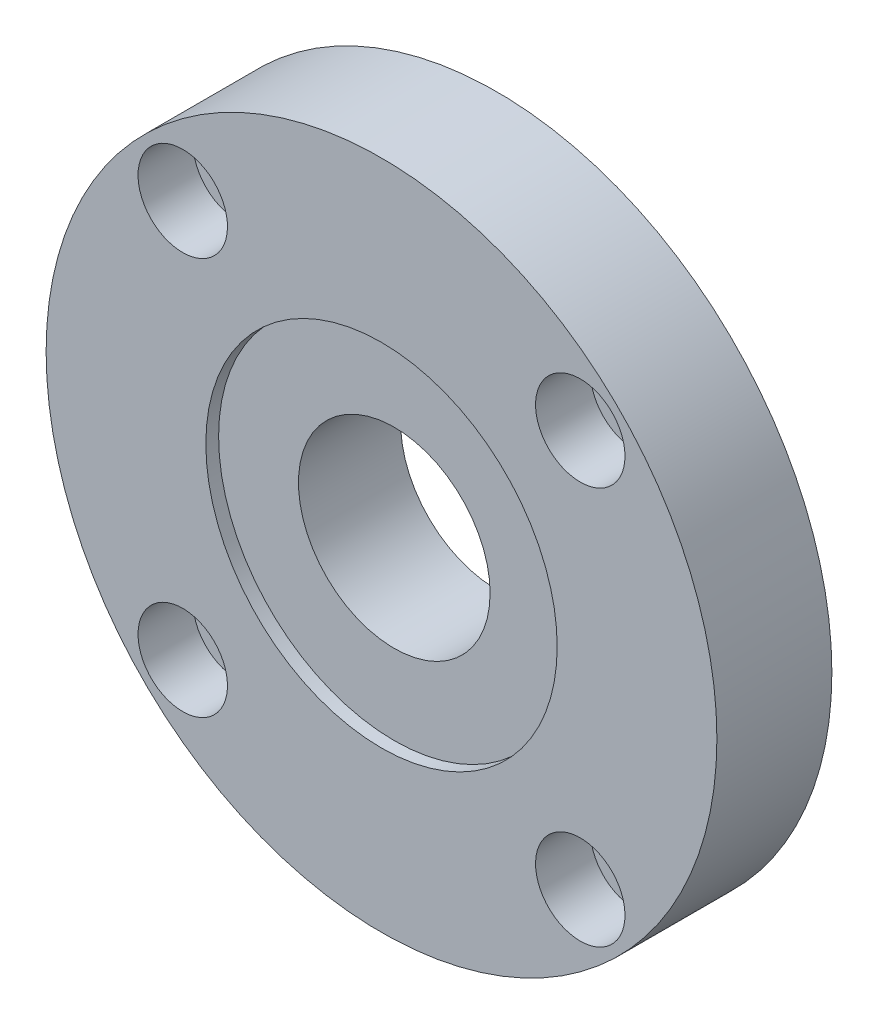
ISO-10303-21;
HEADER;
FILE_DESCRIPTION(('STEP AP214'),'2;1');
FILE_NAME('part.step','',(''),(''),'','','');
FILE_SCHEMA(('AUTOMOTIVE_DESIGN { 1 0 10303 214 1 1 1 1 }'));
ENDSEC;
DATA;
#1=APPLICATION_CONTEXT('core data for automotive mechanical design processes');
#2=APPLICATION_PROTOCOL_DEFINITION('international standard','automotive_design',2000,#1);
#3=PRODUCT_CONTEXT('',#1,'mechanical');
#4=PRODUCT('Part','Part','',(#3));
#5=PRODUCT_RELATED_PRODUCT_CATEGORY('part','',(#4));
#6=PRODUCT_DEFINITION_FORMATION('','',#4);
#7=PRODUCT_DEFINITION_CONTEXT('part definition',#1,'design');
#8=PRODUCT_DEFINITION('design','',#6,#7);
#9=PRODUCT_DEFINITION_SHAPE('','',#8);
#10=(LENGTH_UNIT() NAMED_UNIT(*) SI_UNIT(.MILLI.,.METRE.));
#11=(NAMED_UNIT(*) PLANE_ANGLE_UNIT() SI_UNIT($,.RADIAN.));
#12=(NAMED_UNIT(*) SI_UNIT($,.STERADIAN.) SOLID_ANGLE_UNIT());
#13=UNCERTAINTY_MEASURE_WITH_UNIT(LENGTH_MEASURE(1.E-05),#10,'distance_accuracy_value','');
#14=(GEOMETRIC_REPRESENTATION_CONTEXT(3) GLOBAL_UNCERTAINTY_ASSIGNED_CONTEXT((#13)) GLOBAL_UNIT_ASSIGNED_CONTEXT((#10,
#11,#12)) REPRESENTATION_CONTEXT('',''));
#15=CARTESIAN_POINT('',(0.,0.,0.));
#16=DIRECTION('',(0.,0.,1.));
#17=DIRECTION('',(1.,0.,0.));
#18=AXIS2_PLACEMENT_3D('',#15,#16,#17);
#19=CARTESIAN_POINT('',(0.,0.,18.));
#20=DIRECTION('',(0.,0.,-1.));
#21=DIRECTION('',(-1.,0.,0.));
#22=AXIS2_PLACEMENT_3D('',#19,#20,#21);
#23=CYLINDRICAL_SURFACE('',#22,15.);
#24=CARTESIAN_POINT('',(0.,0.,0.));
#25=DIRECTION('',(0.,0.,1.));
#26=DIRECTION('',(1.,0.,0.));
#27=AXIS2_PLACEMENT_3D('',#24,#25,#26);
#28=CIRCLE('',#27,15.);
#29=CARTESIAN_POINT('',(15.,0.,0.));
#30=VERTEX_POINT('',#29);
#31=EDGE_CURVE('E25',#30,#30,#28,.T.);
#32=ORIENTED_EDGE('',*,*,#31,.F.);
#33=EDGE_LOOP('',(#32));
#34=FACE_BOUND('',#33,.T.);
#35=CARTESIAN_POINT('',(0.,0.,16.));
#36=DIRECTION('',(0.,0.,1.));
#37=DIRECTION('',(1.,0.,0.));
#38=AXIS2_PLACEMENT_3D('',#35,#36,#37);
#39=CIRCLE('',#38,15.);
#40=CARTESIAN_POINT('',(15.,0.,16.));
#41=VERTEX_POINT('',#40);
#42=EDGE_CURVE('E16',#41,#41,#39,.T.);
#43=ORIENTED_EDGE('',*,*,#42,.T.);
#44=EDGE_LOOP('',(#43));
#45=FACE_BOUND('',#44,.T.);
#46=ADVANCED_FACE('F12',(#34,#45),#23,.F.);
#47=CARTESIAN_POINT('',(-31.1126983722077,31.1126983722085,0.));
#48=DIRECTION('',(0.,0.,1.));
#49=DIRECTION('',(1.,0.,0.));
#50=AXIS2_PLACEMENT_3D('',#47,#48,#49);
#51=CYLINDRICAL_SURFACE('',#50,5.);
#52=CARTESIAN_POINT('',(-31.1126983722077,31.1126983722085,0.));
#53=DIRECTION('',(0.,0.,1.));
#54=DIRECTION('',(0.,1.,0.));
#55=AXIS2_PLACEMENT_3D('',#52,#53,#54);
#56=CIRCLE('',#55,5.);
#57=CARTESIAN_POINT('',(-31.1126983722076,36.1126983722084,0.));
#58=VERTEX_POINT('',#57);
#59=EDGE_CURVE('E37',#58,#58,#56,.T.);
#60=ORIENTED_EDGE('',*,*,#59,.F.);
#61=EDGE_LOOP('',(#60));
#62=FACE_BOUND('',#61,.T.);
#63=CARTESIAN_POINT('',(-31.1126983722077,31.1126983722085,9.4));
#64=DIRECTION('',(0.,0.,1.));
#65=DIRECTION('',(1.,0.,0.));
#66=AXIS2_PLACEMENT_3D('',#63,#64,#65);
#67=CIRCLE('',#66,5.);
#68=CARTESIAN_POINT('',(-26.1126983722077,31.1126983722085,9.4));
#69=VERTEX_POINT('',#68);
#70=EDGE_CURVE('E43',#69,#69,#67,.F.);
#71=ORIENTED_EDGE('',*,*,#70,.F.);
#72=EDGE_LOOP('',(#71));
#73=FACE_BOUND('',#72,.T.);
#74=ADVANCED_FACE('F87',(#62,#73),#51,.F.);
#75=CARTESIAN_POINT('',(-31.1126983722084,-31.1126983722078,0.));
#76=DIRECTION('',(0.,0.,1.));
#77=DIRECTION('',(1.,0.,0.));
#78=AXIS2_PLACEMENT_3D('',#75,#76,#77);
#79=CYLINDRICAL_SURFACE('',#78,5.);
#80=CARTESIAN_POINT('',(-31.1126983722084,-31.1126983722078,0.));
#81=DIRECTION('',(0.,0.,1.));
#82=DIRECTION('',(-1.,0.,0.));
#83=AXIS2_PLACEMENT_3D('',#80,#81,#82);
#84=CIRCLE('',#83,5.);
#85=CARTESIAN_POINT('',(-36.1126983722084,-31.1126983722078,0.));
#86=VERTEX_POINT('',#85);
#87=EDGE_CURVE('E68',#86,#86,#84,.T.);
#88=ORIENTED_EDGE('',*,*,#87,.F.);
#89=EDGE_LOOP('',(#88));
#90=FACE_BOUND('',#89,.T.);
#91=CARTESIAN_POINT('',(-31.1126983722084,-31.1126983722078,9.4));
#92=DIRECTION('',(0.,0.,1.));
#93=DIRECTION('',(1.,0.,0.));
#94=AXIS2_PLACEMENT_3D('',#91,#92,#93);
#95=CIRCLE('',#94,5.);
#96=CARTESIAN_POINT('',(-26.1126983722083,-31.1126983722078,9.4));
#97=VERTEX_POINT('',#96);
#98=EDGE_CURVE('E39',#97,#97,#95,.F.);
#99=ORIENTED_EDGE('',*,*,#98,.F.);
#100=EDGE_LOOP('',(#99));
#101=FACE_BOUND('',#100,.T.);
#102=ADVANCED_FACE('F160',(#90,#101),#79,.F.);
#103=CARTESIAN_POINT('',(31.112698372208,-31.1126983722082,0.));
#104=DIRECTION('',(0.,0.,1.));
#105=DIRECTION('',(1.,0.,0.));
#106=AXIS2_PLACEMENT_3D('',#103,#104,#105);
#107=CYLINDRICAL_SURFACE('',#106,5.);
#108=CARTESIAN_POINT('',(31.112698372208,-31.1126983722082,0.));
#109=DIRECTION('',(0.,0.,1.));
#110=DIRECTION('',(0.,-1.,0.));
#111=AXIS2_PLACEMENT_3D('',#108,#109,#110);
#112=CIRCLE('',#111,5.);
#113=CARTESIAN_POINT('',(31.1126983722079,-36.1126983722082,0.));
#114=VERTEX_POINT('',#113);
#115=EDGE_CURVE('E71',#114,#114,#112,.T.);
#116=ORIENTED_EDGE('',*,*,#115,.F.);
#117=EDGE_LOOP('',(#116));
#118=FACE_BOUND('',#117,.T.);
#119=CARTESIAN_POINT('',(31.112698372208,-31.1126983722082,9.4));
#120=DIRECTION('',(0.,0.,1.));
#121=DIRECTION('',(1.,0.,0.));
#122=AXIS2_PLACEMENT_3D('',#119,#120,#121);
#123=CIRCLE('',#122,5.);
#124=CARTESIAN_POINT('',(36.112698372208,-31.1126983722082,9.4));
#125=VERTEX_POINT('',#124);
#126=EDGE_CURVE('E34',#125,#125,#123,.F.);
#127=ORIENTED_EDGE('',*,*,#126,.F.);
#128=EDGE_LOOP('',(#127));
#129=FACE_BOUND('',#128,.T.);
#130=ADVANCED_FACE('F135',(#118,#129),#107,.F.);
#131=CARTESIAN_POINT('',(31.1126983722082,31.1126983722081,0.));
#132=DIRECTION('',(0.,0.,1.));
#133=DIRECTION('',(1.,0.,0.));
#134=AXIS2_PLACEMENT_3D('',#131,#132,#133);
#135=CYLINDRICAL_SURFACE('',#134,5.);
#136=CARTESIAN_POINT('',(31.1126983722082,31.1126983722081,0.));
#137=DIRECTION('',(0.,0.,1.));
#138=DIRECTION('',(1.,0.,0.));
#139=AXIS2_PLACEMENT_3D('',#136,#137,#138);
#140=CIRCLE('',#139,5.);
#141=CARTESIAN_POINT('',(36.1126983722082,31.1126983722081,0.));
#142=VERTEX_POINT('',#141);
#143=EDGE_CURVE('E32',#142,#142,#140,.T.);
#144=ORIENTED_EDGE('',*,*,#143,.F.);
#145=EDGE_LOOP('',(#144));
#146=FACE_BOUND('',#145,.T.);
#147=CARTESIAN_POINT('',(31.1126983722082,31.1126983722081,9.4));
#148=DIRECTION('',(0.,0.,1.));
#149=DIRECTION('',(1.,0.,0.));
#150=AXIS2_PLACEMENT_3D('',#147,#148,#149);
#151=CIRCLE('',#150,5.);
#152=CARTESIAN_POINT('',(36.1126983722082,31.1126983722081,9.4));
#153=VERTEX_POINT('',#152);
#154=EDGE_CURVE('E29',#153,#153,#151,.F.);
#155=ORIENTED_EDGE('',*,*,#154,.F.);
#156=EDGE_LOOP('',(#155));
#157=FACE_BOUND('',#156,.T.);
#158=ADVANCED_FACE('F106',(#146,#157),#135,.F.);
#159=CARTESIAN_POINT('',(0.,0.,18.));
#160=DIRECTION('',(0.,0.,1.));
#161=DIRECTION('',(1.,0.,0.));
#162=AXIS2_PLACEMENT_3D('',#159,#160,#161);
#163=PLANE('',#162);
#164=CARTESIAN_POINT('',(0.,0.,18.));
#165=DIRECTION('',(0.,0.,1.));
#166=DIRECTION('',(1.,0.,0.));
#167=AXIS2_PLACEMENT_3D('',#164,#165,#166);
#168=CIRCLE('',#167,27.5);
#169=CARTESIAN_POINT('',(27.5,0.,18.));
#170=VERTEX_POINT('',#169);
#171=EDGE_CURVE('E94',#170,#170,#168,.T.);
#172=ORIENTED_EDGE('',*,*,#171,.F.);
#173=EDGE_LOOP('',(#172));
#174=FACE_BOUND('',#173,.T.);
#175=CARTESIAN_POINT('',(-31.1126983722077,31.1126983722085,18.));
#176=DIRECTION('',(0.,0.,1.));
#177=DIRECTION('',(0.,1.,0.));
#178=AXIS2_PLACEMENT_3D('',#175,#176,#177);
#179=CIRCLE('',#178,7.);
#180=CARTESIAN_POINT('',(-31.1126983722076,38.1126983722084,18.));
#181=VERTEX_POINT('',#180);
#182=EDGE_CURVE('E52',#181,#181,#179,.T.);
#183=ORIENTED_EDGE('',*,*,#182,.F.);
#184=EDGE_LOOP('',(#183));
#185=FACE_BOUND('',#184,.T.);
#186=CARTESIAN_POINT('',(-31.1126983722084,-31.1126983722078,18.));
#187=DIRECTION('',(0.,0.,1.));
#188=DIRECTION('',(-1.,0.,0.));
#189=AXIS2_PLACEMENT_3D('',#186,#187,#188);
#190=CIRCLE('',#189,7.);
#191=CARTESIAN_POINT('',(-38.1126983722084,-31.1126983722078,18.));
#192=VERTEX_POINT('',#191);
#193=EDGE_CURVE('E45',#192,#192,#190,.T.);
#194=ORIENTED_EDGE('',*,*,#193,.F.);
#195=EDGE_LOOP('',(#194));
#196=FACE_BOUND('',#195,.T.);
#197=CARTESIAN_POINT('',(31.112698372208,-31.1126983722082,18.));
#198=DIRECTION('',(0.,0.,1.));
#199=DIRECTION('',(0.,-1.,0.));
#200=AXIS2_PLACEMENT_3D('',#197,#198,#199);
#201=CIRCLE('',#200,7.);
#202=CARTESIAN_POINT('',(31.1126983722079,-38.1126983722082,18.));
#203=VERTEX_POINT('',#202);
#204=EDGE_CURVE('E41',#203,#203,#201,.T.);
#205=ORIENTED_EDGE('',*,*,#204,.F.);
#206=EDGE_LOOP('',(#205));
#207=FACE_BOUND('',#206,.T.);
#208=CARTESIAN_POINT('',(31.1126983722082,31.1126983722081,18.));
#209=DIRECTION('',(0.,0.,1.));
#210=DIRECTION('',(1.,0.,0.));
#211=AXIS2_PLACEMENT_3D('',#208,#209,#210);
#212=CIRCLE('',#211,7.);
#213=CARTESIAN_POINT('',(38.1126983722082,31.1126983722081,18.));
#214=VERTEX_POINT('',#213);
#215=EDGE_CURVE('E74',#214,#214,#212,.T.);
#216=ORIENTED_EDGE('',*,*,#215,.F.);
#217=EDGE_LOOP('',(#216));
#218=FACE_BOUND('',#217,.T.);
#219=CARTESIAN_POINT('',(0.,0.,18.));
#220=DIRECTION('',(0.,0.,1.));
#221=DIRECTION('',(1.,0.,0.));
#222=AXIS2_PLACEMENT_3D('',#219,#220,#221);
#223=CIRCLE('',#222,52.5);
#224=CARTESIAN_POINT('',(52.5,0.,18.));
#225=VERTEX_POINT('',#224);
#226=EDGE_CURVE('E8',#225,#225,#223,.T.);
#227=ORIENTED_EDGE('',*,*,#226,.T.);
#228=EDGE_LOOP('',(#227));
#229=FACE_BOUND('',#228,.T.);
#230=ADVANCED_FACE('F103',(#174,#185,#196,#207,#218,#229),#163,.T.);
#231=CARTESIAN_POINT('',(0.,0.,0.));
#232=DIRECTION('',(0.,0.,1.));
#233=DIRECTION('',(1.,0.,0.));
#234=AXIS2_PLACEMENT_3D('',#231,#232,#233);
#235=PLANE('',#234);
#236=ORIENTED_EDGE('',*,*,#59,.T.);
#237=EDGE_LOOP('',(#236));
#238=FACE_BOUND('',#237,.T.);
#239=ORIENTED_EDGE('',*,*,#87,.T.);
#240=EDGE_LOOP('',(#239));
#241=FACE_BOUND('',#240,.T.);
#242=ORIENTED_EDGE('',*,*,#115,.T.);
#243=EDGE_LOOP('',(#242));
#244=FACE_BOUND('',#243,.T.);
#245=ORIENTED_EDGE('',*,*,#143,.T.);
#246=EDGE_LOOP('',(#245));
#247=FACE_BOUND('',#246,.T.);
#248=CARTESIAN_POINT('',(0.,0.,0.));
#249=DIRECTION('',(0.,0.,1.));
#250=DIRECTION('',(1.,0.,0.));
#251=AXIS2_PLACEMENT_3D('',#248,#249,#250);
#252=CIRCLE('',#251,52.5);
#253=CARTESIAN_POINT('',(52.5,0.,0.));
#254=VERTEX_POINT('',#253);
#255=EDGE_CURVE('E20',#254,#254,#252,.T.);
#256=ORIENTED_EDGE('',*,*,#255,.F.);
#257=EDGE_LOOP('',(#256));
#258=FACE_BOUND('',#257,.T.);
#259=ORIENTED_EDGE('',*,*,#31,.T.);
#260=EDGE_LOOP('',(#259));
#261=FACE_BOUND('',#260,.T.);
#262=ADVANCED_FACE('F83',(#238,#241,#244,#247,#258,#261),#235,.F.);
#263=CARTESIAN_POINT('',(0.,0.,18.));
#264=DIRECTION('',(0.,0.,-1.));
#265=DIRECTION('',(-1.,0.,0.));
#266=AXIS2_PLACEMENT_3D('',#263,#264,#265);
#267=CYLINDRICAL_SURFACE('',#266,52.5);
#268=ORIENTED_EDGE('',*,*,#226,.F.);
#269=EDGE_LOOP('',(#268));
#270=FACE_BOUND('',#269,.T.);
#271=ORIENTED_EDGE('',*,*,#255,.T.);
#272=EDGE_LOOP('',(#271));
#273=FACE_BOUND('',#272,.T.);
#274=ADVANCED_FACE('F14',(#270,#273),#267,.T.);
#275=CARTESIAN_POINT('',(31.1126983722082,31.1126983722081,9.4));
#276=DIRECTION('',(0.,0.,1.));
#277=DIRECTION('',(1.,0.,0.));
#278=AXIS2_PLACEMENT_3D('',#275,#276,#277);
#279=PLANE('',#278);
#280=CARTESIAN_POINT('',(31.1126983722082,31.1126983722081,9.4));
#281=DIRECTION('',(0.,0.,1.));
#282=DIRECTION('',(1.,0.,0.));
#283=AXIS2_PLACEMENT_3D('',#280,#281,#282);
#284=CIRCLE('',#283,7.);
#285=CARTESIAN_POINT('',(38.1126983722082,31.1126983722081,9.4));
#286=VERTEX_POINT('',#285);
#287=EDGE_CURVE('E33',#286,#286,#284,.T.);
#288=ORIENTED_EDGE('',*,*,#287,.T.);
#289=EDGE_LOOP('',(#288));
#290=FACE_BOUND('',#289,.T.);
#291=ORIENTED_EDGE('',*,*,#154,.T.);
#292=EDGE_LOOP('',(#291));
#293=FACE_BOUND('',#292,.T.);
#294=ADVANCED_FACE('F118',(#290,#293),#279,.T.);
#295=CARTESIAN_POINT('',(31.1126983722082,31.1126983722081,9.4));
#296=DIRECTION('',(0.,0.,1.));
#297=DIRECTION('',(1.,0.,0.));
#298=AXIS2_PLACEMENT_3D('',#295,#296,#297);
#299=CYLINDRICAL_SURFACE('',#298,7.);
#300=ORIENTED_EDGE('',*,*,#287,.F.);
#301=EDGE_LOOP('',(#300));
#302=FACE_BOUND('',#301,.T.);
#303=ORIENTED_EDGE('',*,*,#215,.T.);
#304=EDGE_LOOP('',(#303));
#305=FACE_BOUND('',#304,.T.);
#306=ADVANCED_FACE('F115',(#302,#305),#299,.F.);
#307=CARTESIAN_POINT('',(31.112698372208,-31.1126983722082,9.4));
#308=DIRECTION('',(0.,0.,1.));
#309=DIRECTION('',(0.,-1.,0.));
#310=AXIS2_PLACEMENT_3D('',#307,#308,#309);
#311=PLANE('',#310);
#312=CARTESIAN_POINT('',(31.112698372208,-31.1126983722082,9.4));
#313=DIRECTION('',(0.,0.,1.));
#314=DIRECTION('',(0.,-1.,0.));
#315=AXIS2_PLACEMENT_3D('',#312,#313,#314);
#316=CIRCLE('',#315,7.);
#317=CARTESIAN_POINT('',(31.1126983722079,-38.1126983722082,9.4));
#318=VERTEX_POINT('',#317);
#319=EDGE_CURVE('E38',#318,#318,#316,.T.);
#320=ORIENTED_EDGE('',*,*,#319,.T.);
#321=EDGE_LOOP('',(#320));
#322=FACE_BOUND('',#321,.T.);
#323=ORIENTED_EDGE('',*,*,#126,.T.);
#324=EDGE_LOOP('',(#323));
#325=FACE_BOUND('',#324,.T.);
#326=ADVANCED_FACE('F117',(#322,#325),#311,.T.);
#327=CARTESIAN_POINT('',(31.112698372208,-31.1126983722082,9.4));
#328=DIRECTION('',(0.,0.,1.));
#329=DIRECTION('',(1.,0.,0.));
#330=AXIS2_PLACEMENT_3D('',#327,#328,#329);
#331=CYLINDRICAL_SURFACE('',#330,7.);
#332=ORIENTED_EDGE('',*,*,#319,.F.);
#333=EDGE_LOOP('',(#332));
#334=FACE_BOUND('',#333,.T.);
#335=ORIENTED_EDGE('',*,*,#204,.T.);
#336=EDGE_LOOP('',(#335));
#337=FACE_BOUND('',#336,.T.);
#338=ADVANCED_FACE('F126',(#334,#337),#331,.F.);
#339=CARTESIAN_POINT('',(-31.1126983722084,-31.1126983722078,9.4));
#340=DIRECTION('',(0.,0.,1.));
#341=DIRECTION('',(-1.,0.,0.));
#342=AXIS2_PLACEMENT_3D('',#339,#340,#341);
#343=PLANE('',#342);
#344=CARTESIAN_POINT('',(-31.1126983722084,-31.1126983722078,9.4));
#345=DIRECTION('',(0.,0.,1.));
#346=DIRECTION('',(-1.,0.,0.));
#347=AXIS2_PLACEMENT_3D('',#344,#345,#346);
#348=CIRCLE('',#347,7.);
#349=CARTESIAN_POINT('',(-38.1126983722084,-31.1126983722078,9.4));
#350=VERTEX_POINT('',#349);
#351=EDGE_CURVE('E42',#350,#350,#348,.T.);
#352=ORIENTED_EDGE('',*,*,#351,.T.);
#353=EDGE_LOOP('',(#352));
#354=FACE_BOUND('',#353,.T.);
#355=ORIENTED_EDGE('',*,*,#98,.T.);
#356=EDGE_LOOP('',(#355));
#357=FACE_BOUND('',#356,.T.);
#358=ADVANCED_FACE('F173',(#354,#357),#343,.T.);
#359=CARTESIAN_POINT('',(-31.1126983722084,-31.1126983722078,9.4));
#360=DIRECTION('',(0.,0.,1.));
#361=DIRECTION('',(1.,0.,0.));
#362=AXIS2_PLACEMENT_3D('',#359,#360,#361);
#363=CYLINDRICAL_SURFACE('',#362,7.);
#364=ORIENTED_EDGE('',*,*,#351,.F.);
#365=EDGE_LOOP('',(#364));
#366=FACE_BOUND('',#365,.T.);
#367=ORIENTED_EDGE('',*,*,#193,.T.);
#368=EDGE_LOOP('',(#367));
#369=FACE_BOUND('',#368,.T.);
#370=ADVANCED_FACE('F176',(#366,#369),#363,.F.);
#371=CARTESIAN_POINT('',(-31.1126983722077,31.1126983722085,9.4));
#372=DIRECTION('',(0.,0.,1.));
#373=DIRECTION('',(0.,1.,0.));
#374=AXIS2_PLACEMENT_3D('',#371,#372,#373);
#375=PLANE('',#374);
#376=CARTESIAN_POINT('',(-31.1126983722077,31.1126983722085,9.4));
#377=DIRECTION('',(0.,0.,1.));
#378=DIRECTION('',(0.,1.,0.));
#379=AXIS2_PLACEMENT_3D('',#376,#377,#378);
#380=CIRCLE('',#379,7.);
#381=CARTESIAN_POINT('',(-31.1126983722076,38.1126983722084,9.4));
#382=VERTEX_POINT('',#381);
#383=EDGE_CURVE('E46',#382,#382,#380,.T.);
#384=ORIENTED_EDGE('',*,*,#383,.T.);
#385=EDGE_LOOP('',(#384));
#386=FACE_BOUND('',#385,.T.);
#387=ORIENTED_EDGE('',*,*,#70,.T.);
#388=EDGE_LOOP('',(#387));
#389=FACE_BOUND('',#388,.T.);
#390=ADVANCED_FACE('F179',(#386,#389),#375,.T.);
#391=CARTESIAN_POINT('',(-31.1126983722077,31.1126983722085,9.4));
#392=DIRECTION('',(0.,0.,1.));
#393=DIRECTION('',(1.,0.,0.));
#394=AXIS2_PLACEMENT_3D('',#391,#392,#393);
#395=CYLINDRICAL_SURFACE('',#394,7.);
#396=ORIENTED_EDGE('',*,*,#383,.F.);
#397=EDGE_LOOP('',(#396));
#398=FACE_BOUND('',#397,.T.);
#399=ORIENTED_EDGE('',*,*,#182,.T.);
#400=EDGE_LOOP('',(#399));
#401=FACE_BOUND('',#400,.T.);
#402=ADVANCED_FACE('F184',(#398,#401),#395,.F.);
#403=CARTESIAN_POINT('',(0.,0.,16.));
#404=DIRECTION('',(0.,0.,1.));
#405=DIRECTION('',(1.,0.,0.));
#406=AXIS2_PLACEMENT_3D('',#403,#404,#405);
#407=CYLINDRICAL_SURFACE('',#406,27.5);
#408=CARTESIAN_POINT('',(0.,0.,16.));
#409=DIRECTION('',(0.,0.,1.));
#410=DIRECTION('',(1.,0.,0.));
#411=AXIS2_PLACEMENT_3D('',#408,#409,#410);
#412=CIRCLE('',#411,27.5);
#413=CARTESIAN_POINT('',(27.5,0.,16.));
#414=VERTEX_POINT('',#413);
#415=EDGE_CURVE('E92',#414,#414,#412,.T.);
#416=ORIENTED_EDGE('',*,*,#415,.F.);
#417=EDGE_LOOP('',(#416));
#418=FACE_BOUND('',#417,.T.);
#419=ORIENTED_EDGE('',*,*,#171,.T.);
#420=EDGE_LOOP('',(#419));
#421=FACE_BOUND('',#420,.T.);
#422=ADVANCED_FACE('F101',(#418,#421),#407,.F.);
#423=CARTESIAN_POINT('',(0.,0.,16.));
#424=DIRECTION('',(0.,0.,1.));
#425=DIRECTION('',(1.,0.,0.));
#426=AXIS2_PLACEMENT_3D('',#423,#424,#425);
#427=PLANE('',#426);
#428=ORIENTED_EDGE('',*,*,#42,.F.);
#429=EDGE_LOOP('',(#428));
#430=FACE_BOUND('',#429,.T.);
#431=ORIENTED_EDGE('',*,*,#415,.T.);
#432=EDGE_LOOP('',(#431));
#433=FACE_BOUND('',#432,.T.);
#434=ADVANCED_FACE('F188',(#430,#433),#427,.T.);
#435=CLOSED_SHELL('',(#46,#74,#102,#130,#158,#230,#262,#274,#294,#306,#326,#338,#358,#370,#390,
#402,#422,#434));
#436=MANIFOLD_SOLID_BREP('B1',#435);
#437=ADVANCED_BREP_SHAPE_REPRESENTATION('',(#18,#436),#14);
#438=SHAPE_DEFINITION_REPRESENTATION(#9,#437);
ENDSEC;
END-ISO-10303-21;
